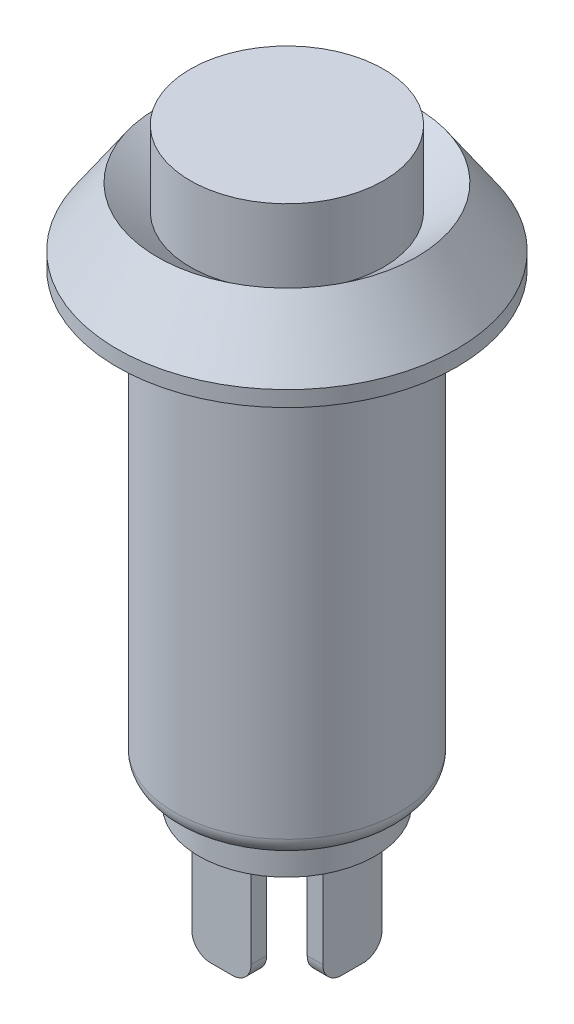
ISO-10303-21;
HEADER;
FILE_DESCRIPTION(('STEP AP214'),'2;1');
FILE_NAME('part.step','',(''),(''),'','','');
FILE_SCHEMA(('AUTOMOTIVE_DESIGN { 1 0 10303 214 1 1 1 1 }'));
ENDSEC;
DATA;
#1=APPLICATION_CONTEXT('core data for automotive mechanical design processes');
#2=APPLICATION_PROTOCOL_DEFINITION('international standard','automotive_design',2000,#1);
#3=PRODUCT_CONTEXT('',#1,'mechanical');
#4=PRODUCT('Part','Part','',(#3));
#5=PRODUCT_RELATED_PRODUCT_CATEGORY('part','',(#4));
#6=PRODUCT_DEFINITION_FORMATION('','',#4);
#7=PRODUCT_DEFINITION_CONTEXT('part definition',#1,'design');
#8=PRODUCT_DEFINITION('design','',#6,#7);
#9=PRODUCT_DEFINITION_SHAPE('','',#8);
#10=(LENGTH_UNIT() NAMED_UNIT(*) SI_UNIT(.MILLI.,.METRE.));
#11=(NAMED_UNIT(*) PLANE_ANGLE_UNIT() SI_UNIT($,.RADIAN.));
#12=(NAMED_UNIT(*) SI_UNIT($,.STERADIAN.) SOLID_ANGLE_UNIT());
#13=UNCERTAINTY_MEASURE_WITH_UNIT(LENGTH_MEASURE(1.E-05),#10,'distance_accuracy_value','');
#14=(GEOMETRIC_REPRESENTATION_CONTEXT(3) GLOBAL_UNCERTAINTY_ASSIGNED_CONTEXT((#13)) GLOBAL_UNIT_ASSIGNED_CONTEXT((#10,
#11,#12)) REPRESENTATION_CONTEXT('',''));
#15=CARTESIAN_POINT('',(0.,0.,0.));
#16=DIRECTION('',(0.,0.,1.));
#17=DIRECTION('',(1.,0.,0.));
#18=AXIS2_PLACEMENT_3D('',#15,#16,#17);
#19=CARTESIAN_POINT('',(0.,-18.9,0.));
#20=DIRECTION('',(0.,-1.,0.));
#21=DIRECTION('',(1.,0.,0.));
#22=AXIS2_PLACEMENT_3D('',#19,#20,#21);
#23=PLANE('',#22);
#24=CARTESIAN_POINT('',(0.,-18.9,0.));
#25=DIRECTION('',(0.,-1.,0.));
#26=DIRECTION('',(1.,0.,0.));
#27=AXIS2_PLACEMENT_3D('',#24,#25,#26);
#28=CIRCLE('',#27,2.825);
#29=CARTESIAN_POINT('',(2.825,-18.9,0.));
#30=VERTEX_POINT('',#29);
#31=EDGE_CURVE('E313',#30,#30,#28,.T.);
#32=ORIENTED_EDGE('',*,*,#31,.T.);
#33=EDGE_LOOP('',(#32));
#34=FACE_BOUND('',#33,.T.);
#35=DIRECTION('',(-1.,0.,0.));
#36=VECTOR('',#35,1.);
#37=CARTESIAN_POINT('',(-0.95,-18.9,2.1));
#38=LINE('',#37,#36);
#39=CARTESIAN_POINT('',(0.95,-18.9,2.1));
#40=VERTEX_POINT('',#39);
#41=CARTESIAN_POINT('',(-0.95,-18.9,2.1));
#42=VERTEX_POINT('',#41);
#43=EDGE_CURVE('E298',#40,#42,#38,.T.);
#44=ORIENTED_EDGE('',*,*,#43,.F.);
#45=DIRECTION('',(0.,0.,1.));
#46=VECTOR('',#45,1.);
#47=CARTESIAN_POINT('',(0.95,-18.9,2.1));
#48=LINE('',#47,#46);
#49=CARTESIAN_POINT('',(0.95,-18.9,1.6));
#50=VERTEX_POINT('',#49);
#51=EDGE_CURVE('E283',#50,#40,#48,.T.);
#52=ORIENTED_EDGE('',*,*,#51,.F.);
#53=DIRECTION('',(1.,0.,0.));
#54=VECTOR('',#53,1.);
#55=CARTESIAN_POINT('',(-0.95,-18.9,1.6));
#56=LINE('',#55,#54);
#57=CARTESIAN_POINT('',(-0.95,-18.9,1.6));
#58=VERTEX_POINT('',#57);
#59=EDGE_CURVE('E292',#58,#50,#56,.T.);
#60=ORIENTED_EDGE('',*,*,#59,.F.);
#61=DIRECTION('',(0.,0.,-1.));
#62=VECTOR('',#61,1.);
#63=CARTESIAN_POINT('',(-0.95,-18.9,2.1));
#64=LINE('',#63,#62);
#65=EDGE_CURVE('E301',#42,#58,#64,.T.);
#66=ORIENTED_EDGE('',*,*,#65,.F.);
#67=EDGE_LOOP('',(#44,#52,#60,#66));
#68=FACE_BOUND('',#67,.T.);
#69=DIRECTION('',(1.,0.,0.));
#70=VECTOR('',#69,1.);
#71=CARTESIAN_POINT('',(2.10000000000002,-18.9,-0.949999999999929));
#72=LINE('',#71,#70);
#73=CARTESIAN_POINT('',(1.60000000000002,-18.9,-0.949999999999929));
#74=VERTEX_POINT('',#73);
#75=CARTESIAN_POINT('',(2.10000000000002,-18.9,-0.949999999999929));
#76=VERTEX_POINT('',#75);
#77=EDGE_CURVE('E277',#74,#76,#72,.T.);
#78=ORIENTED_EDGE('',*,*,#77,.F.);
#79=DIRECTION('',(0.,0.,-1.));
#80=VECTOR('',#79,1.);
#81=CARTESIAN_POINT('',(1.60000000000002,-18.9,0.950000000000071));
#82=LINE('',#81,#80);
#83=CARTESIAN_POINT('',(1.60000000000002,-18.9,0.950000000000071));
#84=VERTEX_POINT('',#83);
#85=EDGE_CURVE('E280',#84,#74,#82,.T.);
#86=ORIENTED_EDGE('',*,*,#85,.F.);
#87=DIRECTION('',(-1.,0.,0.));
#88=VECTOR('',#87,1.);
#89=CARTESIAN_POINT('',(2.10000000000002,-18.9,0.950000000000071));
#90=LINE('',#89,#88);
#91=CARTESIAN_POINT('',(2.10000000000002,-18.9,0.950000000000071));
#92=VERTEX_POINT('',#91);
#93=EDGE_CURVE('E270',#92,#84,#90,.T.);
#94=ORIENTED_EDGE('',*,*,#93,.F.);
#95=DIRECTION('',(0.,0.,1.));
#96=VECTOR('',#95,1.);
#97=CARTESIAN_POINT('',(2.10000000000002,-18.9,0.950000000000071));
#98=LINE('',#97,#96);
#99=EDGE_CURVE('E273',#76,#92,#98,.T.);
#100=ORIENTED_EDGE('',*,*,#99,.F.);
#101=EDGE_LOOP('',(#78,#86,#94,#100));
#102=FACE_BOUND('',#101,.T.);
#103=DIRECTION('',(0.,0.,-1.));
#104=VECTOR('',#103,1.);
#105=CARTESIAN_POINT('',(-0.94999999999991,-18.9,-2.09999999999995));
#106=LINE('',#105,#104);
#107=CARTESIAN_POINT('',(-0.94999999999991,-18.9,-1.59999999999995));
#108=VERTEX_POINT('',#107);
#109=CARTESIAN_POINT('',(-0.94999999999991,-18.9,-2.09999999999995));
#110=VERTEX_POINT('',#109);
#111=EDGE_CURVE('E251',#108,#110,#106,.T.);
#112=ORIENTED_EDGE('',*,*,#111,.F.);
#113=DIRECTION('',(-1.,0.,0.));
#114=VECTOR('',#113,1.);
#115=CARTESIAN_POINT('',(0.95000000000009,-18.9,-1.59999999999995));
#116=LINE('',#115,#114);
#117=CARTESIAN_POINT('',(0.95000000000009,-18.9,-1.59999999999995));
#118=VERTEX_POINT('',#117);
#119=EDGE_CURVE('E254',#118,#108,#116,.T.);
#120=ORIENTED_EDGE('',*,*,#119,.F.);
#121=DIRECTION('',(0.,0.,1.));
#122=VECTOR('',#121,1.);
#123=CARTESIAN_POINT('',(0.95000000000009,-18.9,-2.09999999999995));
#124=LINE('',#123,#122);
#125=CARTESIAN_POINT('',(0.95000000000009,-18.9,-2.09999999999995));
#126=VERTEX_POINT('',#125);
#127=EDGE_CURVE('E244',#126,#118,#124,.T.);
#128=ORIENTED_EDGE('',*,*,#127,.F.);
#129=DIRECTION('',(1.,0.,0.));
#130=VECTOR('',#129,1.);
#131=CARTESIAN_POINT('',(0.95000000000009,-18.9,-2.09999999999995));
#132=LINE('',#131,#130);
#133=EDGE_CURVE('E247',#110,#126,#132,.T.);
#134=ORIENTED_EDGE('',*,*,#133,.F.);
#135=EDGE_LOOP('',(#112,#120,#128,#134));
#136=FACE_BOUND('',#135,.T.);
#137=DIRECTION('',(-1.,0.,0.));
#138=VECTOR('',#137,1.);
#139=CARTESIAN_POINT('',(-2.09999999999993,-18.9,0.949999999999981));
#140=LINE('',#139,#138);
#141=CARTESIAN_POINT('',(-1.59999999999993,-18.9,0.949999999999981));
#142=VERTEX_POINT('',#141);
#143=CARTESIAN_POINT('',(-2.09999999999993,-18.9,0.949999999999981));
#144=VERTEX_POINT('',#143);
#145=EDGE_CURVE('E226',#142,#144,#140,.T.);
#146=ORIENTED_EDGE('',*,*,#145,.F.);
#147=DIRECTION('',(0.,0.,1.));
#148=VECTOR('',#147,1.);
#149=CARTESIAN_POINT('',(-1.59999999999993,-18.9,-0.950000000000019));
#150=LINE('',#149,#148);
#151=CARTESIAN_POINT('',(-1.59999999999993,-18.9,-0.950000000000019));
#152=VERTEX_POINT('',#151);
#153=EDGE_CURVE('E206',#152,#142,#150,.T.);
#154=ORIENTED_EDGE('',*,*,#153,.F.);
#155=DIRECTION('',(1.,0.,0.));
#156=VECTOR('',#155,1.);
#157=CARTESIAN_POINT('',(-2.09999999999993,-18.9,-0.950000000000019));
#158=LINE('',#157,#156);
#159=CARTESIAN_POINT('',(-2.09999999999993,-18.9,-0.950000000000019));
#160=VERTEX_POINT('',#159);
#161=EDGE_CURVE('E216',#160,#152,#158,.T.);
#162=ORIENTED_EDGE('',*,*,#161,.F.);
#163=DIRECTION('',(0.,0.,-1.));
#164=VECTOR('',#163,1.);
#165=CARTESIAN_POINT('',(-2.09999999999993,-18.9,-0.950000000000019));
#166=LINE('',#165,#164);
#167=EDGE_CURVE('E222',#144,#160,#166,.T.);
#168=ORIENTED_EDGE('',*,*,#167,.F.);
#169=EDGE_LOOP('',(#146,#154,#162,#168));
#170=FACE_BOUND('',#169,.T.);
#171=ADVANCED_FACE('F39',(#34,#68,#102,#136,#170),#23,.T.);
#172=CARTESIAN_POINT('',(0.,0.,0.));
#173=DIRECTION('',(0.,1.,0.));
#174=DIRECTION('',(-1.,0.,0.));
#175=AXIS2_PLACEMENT_3D('',#172,#173,#174);
#176=PLANE('',#175);
#177=CARTESIAN_POINT('',(0.,0.,0.));
#178=DIRECTION('',(0.,-1.,0.));
#179=DIRECTION('',(1.,0.,0.));
#180=AXIS2_PLACEMENT_3D('',#177,#178,#179);
#181=CIRCLE('',#180,3.1);
#182=CARTESIAN_POINT('',(3.1,0.,0.));
#183=VERTEX_POINT('',#182);
#184=EDGE_CURVE('E321',#183,#183,#181,.T.);
#185=ORIENTED_EDGE('',*,*,#184,.F.);
#186=EDGE_LOOP('',(#185));
#187=FACE_BOUND('',#186,.T.);
#188=ADVANCED_FACE('F421',(#187),#176,.T.);
#189=CARTESIAN_POINT('',(0.,-17.9,0.));
#190=DIRECTION('',(0.,-1.,0.));
#191=DIRECTION('',(1.,0.,0.));
#192=AXIS2_PLACEMENT_3D('',#189,#190,#191);
#193=CYLINDRICAL_SURFACE('',#192,3.1);
#194=ORIENTED_EDGE('',*,*,#184,.T.);
#195=EDGE_LOOP('',(#194));
#196=FACE_BOUND('',#195,.T.);
#197=CARTESIAN_POINT('',(0.,-2.4,0.));
#198=DIRECTION('',(0.,-1.,0.));
#199=DIRECTION('',(1.,0.,0.));
#200=AXIS2_PLACEMENT_3D('',#197,#198,#199);
#201=CIRCLE('',#200,3.1);
#202=CARTESIAN_POINT('',(3.1,-2.4,0.));
#203=VERTEX_POINT('',#202);
#204=EDGE_CURVE('E333',#203,#203,#201,.T.);
#205=ORIENTED_EDGE('',*,*,#204,.F.);
#206=EDGE_LOOP('',(#205));
#207=FACE_BOUND('',#206,.T.);
#208=ADVANCED_FACE('F427',(#196,#207),#193,.T.);
#209=CARTESIAN_POINT('',(0.,-1.6,0.));
#210=DIRECTION('',(0.,1.,0.));
#211=DIRECTION('',(-1.,0.,0.));
#212=AXIS2_PLACEMENT_3D('',#209,#210,#211);
#213=CONICAL_SURFACE('',#212,4.15,0.919719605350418);
#214=ORIENTED_EDGE('',*,*,#204,.T.);
#215=EDGE_LOOP('',(#214));
#216=FACE_BOUND('',#215,.T.);
#217=CARTESIAN_POINT('',(0.,-1.6,0.));
#218=DIRECTION('',(0.,-1.,0.));
#219=DIRECTION('',(1.,0.,0.));
#220=AXIS2_PLACEMENT_3D('',#217,#218,#219);
#221=CIRCLE('',#220,4.15);
#222=CARTESIAN_POINT('',(4.15,-1.6,0.));
#223=VERTEX_POINT('',#222);
#224=EDGE_CURVE('E330',#223,#223,#221,.T.);
#225=ORIENTED_EDGE('',*,*,#224,.F.);
#226=EDGE_LOOP('',(#225));
#227=FACE_BOUND('',#226,.T.);
#228=ADVANCED_FACE('F456',(#216,#227),#213,.F.);
#229=CARTESIAN_POINT('',(0.,-3.5,0.));
#230=DIRECTION('',(0.,-1.,0.));
#231=DIRECTION('',(1.,0.,0.));
#232=AXIS2_PLACEMENT_3D('',#229,#230,#231);
#233=CONICAL_SURFACE('',#232,5.45,0.600050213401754);
#234=ORIENTED_EDGE('',*,*,#224,.T.);
#235=EDGE_LOOP('',(#234));
#236=FACE_BOUND('',#235,.T.);
#237=CARTESIAN_POINT('',(0.,-3.5,0.));
#238=DIRECTION('',(0.,-1.,0.));
#239=DIRECTION('',(1.,0.,0.));
#240=AXIS2_PLACEMENT_3D('',#237,#238,#239);
#241=CIRCLE('',#240,5.45);
#242=CARTESIAN_POINT('',(5.45,-3.5,0.));
#243=VERTEX_POINT('',#242);
#244=EDGE_CURVE('E327',#243,#243,#241,.T.);
#245=ORIENTED_EDGE('',*,*,#244,.F.);
#246=EDGE_LOOP('',(#245));
#247=FACE_BOUND('',#246,.T.);
#248=ADVANCED_FACE('F452',(#236,#247),#233,.T.);
#249=CARTESIAN_POINT('',(0.,-17.9,0.));
#250=DIRECTION('',(0.,-1.,0.));
#251=DIRECTION('',(1.,0.,0.));
#252=AXIS2_PLACEMENT_3D('',#249,#250,#251);
#253=CYLINDRICAL_SURFACE('',#252,5.45);
#254=ORIENTED_EDGE('',*,*,#244,.T.);
#255=EDGE_LOOP('',(#254));
#256=FACE_BOUND('',#255,.T.);
#257=CARTESIAN_POINT('',(0.,-4.,0.));
#258=DIRECTION('',(0.,-1.,0.));
#259=DIRECTION('',(1.,0.,0.));
#260=AXIS2_PLACEMENT_3D('',#257,#258,#259);
#261=CIRCLE('',#260,5.45);
#262=CARTESIAN_POINT('',(5.45,-4.,0.));
#263=VERTEX_POINT('',#262);
#264=EDGE_CURVE('E324',#263,#263,#261,.T.);
#265=ORIENTED_EDGE('',*,*,#264,.F.);
#266=EDGE_LOOP('',(#265));
#267=FACE_BOUND('',#266,.T.);
#268=ADVANCED_FACE('F448',(#256,#267),#253,.T.);
#269=CARTESIAN_POINT('',(5.45,-4.,0.));
#270=DIRECTION('',(0.,-1.,0.));
#271=DIRECTION('',(1.,0.,0.));
#272=AXIS2_PLACEMENT_3D('',#269,#270,#271);
#273=PLANE('',#272);
#274=ORIENTED_EDGE('',*,*,#264,.T.);
#275=EDGE_LOOP('',(#274));
#276=FACE_BOUND('',#275,.T.);
#277=CARTESIAN_POINT('',(0.,-4.,0.));
#278=DIRECTION('',(0.,-1.,0.));
#279=DIRECTION('',(1.,0.,0.));
#280=AXIS2_PLACEMENT_3D('',#277,#278,#279);
#281=CIRCLE('',#280,3.6);
#282=CARTESIAN_POINT('',(3.6,-4.,0.));
#283=VERTEX_POINT('',#282);
#284=EDGE_CURVE('E316',#283,#283,#281,.T.);
#285=ORIENTED_EDGE('',*,*,#284,.F.);
#286=EDGE_LOOP('',(#285));
#287=FACE_BOUND('',#286,.T.);
#288=ADVANCED_FACE('F444',(#276,#287),#273,.T.);
#289=CARTESIAN_POINT('',(0.,-17.9,0.));
#290=DIRECTION('',(0.,-1.,0.));
#291=DIRECTION('',(1.,0.,0.));
#292=AXIS2_PLACEMENT_3D('',#289,#290,#291);
#293=CYLINDRICAL_SURFACE('',#292,3.6);
#294=CARTESIAN_POINT('',(0.,-17.3,0.));
#295=DIRECTION('',(0.,-1.,0.));
#296=DIRECTION('',(1.,0.,0.));
#297=AXIS2_PLACEMENT_3D('',#294,#295,#296);
#298=CIRCLE('',#297,3.6);
#299=CARTESIAN_POINT('',(3.6,-17.3,0.));
#300=VERTEX_POINT('',#299);
#301=EDGE_CURVE('E11',#300,#300,#298,.F.);
#302=ORIENTED_EDGE('',*,*,#301,.T.);
#303=EDGE_LOOP('',(#302));
#304=FACE_BOUND('',#303,.T.);
#305=ORIENTED_EDGE('',*,*,#284,.T.);
#306=EDGE_LOOP('',(#305));
#307=FACE_BOUND('',#306,.T.);
#308=ADVANCED_FACE('F441',(#304,#307),#293,.T.);
#309=CARTESIAN_POINT('',(3.6,-17.9,0.));
#310=DIRECTION('',(0.,-1.,0.));
#311=DIRECTION('',(1.,0.,0.));
#312=AXIS2_PLACEMENT_3D('',#309,#310,#311);
#313=PLANE('',#312);
#314=CARTESIAN_POINT('',(0.,-17.9,0.));
#315=DIRECTION('',(0.,-1.,0.));
#316=DIRECTION('',(1.,0.,0.));
#317=AXIS2_PLACEMENT_3D('',#314,#315,#316);
#318=CIRCLE('',#317,3.);
#319=CARTESIAN_POINT('',(3.,-17.9,0.));
#320=VERTEX_POINT('',#319);
#321=EDGE_CURVE('E47',#320,#320,#318,.T.);
#322=ORIENTED_EDGE('',*,*,#321,.T.);
#323=EDGE_LOOP('',(#322));
#324=FACE_BOUND('',#323,.T.);
#325=CARTESIAN_POINT('',(0.,-17.9,0.));
#326=DIRECTION('',(0.,-1.,0.));
#327=DIRECTION('',(1.,0.,0.));
#328=AXIS2_PLACEMENT_3D('',#325,#326,#327);
#329=CIRCLE('',#328,2.825);
#330=CARTESIAN_POINT('',(2.825,-17.9,0.));
#331=VERTEX_POINT('',#330);
#332=EDGE_CURVE('E317',#331,#331,#329,.T.);
#333=ORIENTED_EDGE('',*,*,#332,.F.);
#334=EDGE_LOOP('',(#333));
#335=FACE_BOUND('',#334,.T.);
#336=ADVANCED_FACE('F408',(#324,#335),#313,.T.);
#337=CARTESIAN_POINT('',(0.,-18.9,0.));
#338=DIRECTION('',(0.,1.,0.));
#339=DIRECTION('',(-1.,0.,0.));
#340=AXIS2_PLACEMENT_3D('',#337,#338,#339);
#341=CYLINDRICAL_SURFACE('',#340,2.825);
#342=ORIENTED_EDGE('',*,*,#31,.F.);
#343=EDGE_LOOP('',(#342));
#344=FACE_BOUND('',#343,.T.);
#345=ORIENTED_EDGE('',*,*,#332,.T.);
#346=EDGE_LOOP('',(#345));
#347=FACE_BOUND('',#346,.T.);
#348=ADVANCED_FACE('F435',(#344,#347),#341,.T.);
#349=CARTESIAN_POINT('',(0.95,-22.4,2.1));
#350=DIRECTION('',(-1.,0.,0.));
#351=DIRECTION('',(0.,0.,1.));
#352=AXIS2_PLACEMENT_3D('',#349,#350,#351);
#353=PLANE('',#352);
#354=DIRECTION('',(0.,1.,0.));
#355=VECTOR('',#354,1.);
#356=CARTESIAN_POINT('',(0.95,-22.4,2.1));
#357=LINE('',#356,#355);
#358=CARTESIAN_POINT('',(0.95,-21.8,2.1));
#359=VERTEX_POINT('',#358);
#360=EDGE_CURVE('E311',#359,#40,#357,.T.);
#361=ORIENTED_EDGE('',*,*,#360,.F.);
#362=DIRECTION('',(0.,0.,1.));
#363=VECTOR('',#362,1.);
#364=CARTESIAN_POINT('',(0.95,-21.8,1.6));
#365=LINE('',#364,#363);
#366=CARTESIAN_POINT('',(0.95,-21.8,1.6));
#367=VERTEX_POINT('',#366);
#368=EDGE_CURVE('E365',#359,#367,#365,.F.);
#369=ORIENTED_EDGE('',*,*,#368,.T.);
#370=DIRECTION('',(0.,1.,0.));
#371=VECTOR('',#370,1.);
#372=CARTESIAN_POINT('',(0.95,-22.4,1.6));
#373=LINE('',#372,#371);
#374=EDGE_CURVE('E295',#367,#50,#373,.T.);
#375=ORIENTED_EDGE('',*,*,#374,.T.);
#376=ORIENTED_EDGE('',*,*,#51,.T.);
#377=EDGE_LOOP('',(#361,#369,#375,#376));
#378=FACE_BOUND('',#377,.T.);
#379=ADVANCED_FACE('F433',(#378),#353,.F.);
#380=CARTESIAN_POINT('',(-0.95,-22.4,2.1));
#381=DIRECTION('',(0.,0.,-1.));
#382=DIRECTION('',(-1.,0.,0.));
#383=AXIS2_PLACEMENT_3D('',#380,#381,#382);
#384=PLANE('',#383);
#385=DIRECTION('',(-1.,0.,0.));
#386=VECTOR('',#385,1.);
#387=CARTESIAN_POINT('',(-0.95,-22.4,2.1));
#388=LINE('',#387,#386);
#389=CARTESIAN_POINT('',(0.349999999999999,-22.4,2.1));
#390=VERTEX_POINT('',#389);
#391=CARTESIAN_POINT('',(-0.350000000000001,-22.4,2.1));
#392=VERTEX_POINT('',#391);
#393=EDGE_CURVE('E288',#390,#392,#388,.T.);
#394=ORIENTED_EDGE('',*,*,#393,.F.);
#395=CARTESIAN_POINT('',(0.35,-21.8,2.1));
#396=DIRECTION('',(0.,0.,-1.));
#397=DIRECTION('',(-1.,0.,0.));
#398=AXIS2_PLACEMENT_3D('',#395,#396,#397);
#399=CIRCLE('',#398,0.6);
#400=EDGE_CURVE('E363',#390,#359,#399,.F.);
#401=ORIENTED_EDGE('',*,*,#400,.T.);
#402=ORIENTED_EDGE('',*,*,#360,.T.);
#403=ORIENTED_EDGE('',*,*,#43,.T.);
#404=DIRECTION('',(0.,1.,0.));
#405=VECTOR('',#404,1.);
#406=CARTESIAN_POINT('',(-0.95,-22.4,2.1));
#407=LINE('',#406,#405);
#408=CARTESIAN_POINT('',(-0.95,-21.8,2.1));
#409=VERTEX_POINT('',#408);
#410=EDGE_CURVE('E309',#409,#42,#407,.T.);
#411=ORIENTED_EDGE('',*,*,#410,.F.);
#412=CARTESIAN_POINT('',(-0.35,-21.8,2.1));
#413=DIRECTION('',(0.,0.,-1.));
#414=DIRECTION('',(-1.,0.,0.));
#415=AXIS2_PLACEMENT_3D('',#412,#413,#414);
#416=CIRCLE('',#415,0.6);
#417=EDGE_CURVE('E361',#409,#392,#416,.F.);
#418=ORIENTED_EDGE('',*,*,#417,.T.);
#419=EDGE_LOOP('',(#394,#401,#402,#403,#411,#418));
#420=FACE_BOUND('',#419,.T.);
#421=ADVANCED_FACE('F553',(#420),#384,.F.);
#422=CARTESIAN_POINT('',(-0.95,-22.4,2.1));
#423=DIRECTION('',(1.,0.,0.));
#424=DIRECTION('',(0.,0.,-1.));
#425=AXIS2_PLACEMENT_3D('',#422,#423,#424);
#426=PLANE('',#425);
#427=DIRECTION('',(0.,1.,0.));
#428=VECTOR('',#427,1.);
#429=CARTESIAN_POINT('',(-0.95,-22.4,1.6));
#430=LINE('',#429,#428);
#431=CARTESIAN_POINT('',(-0.95,-21.8,1.6));
#432=VERTEX_POINT('',#431);
#433=EDGE_CURVE('E307',#432,#58,#430,.T.);
#434=ORIENTED_EDGE('',*,*,#433,.F.);
#435=DIRECTION('',(0.,0.,-1.));
#436=VECTOR('',#435,1.);
#437=CARTESIAN_POINT('',(-0.95,-21.8,2.1));
#438=LINE('',#437,#436);
#439=EDGE_CURVE('E371',#432,#409,#438,.F.);
#440=ORIENTED_EDGE('',*,*,#439,.T.);
#441=ORIENTED_EDGE('',*,*,#410,.T.);
#442=ORIENTED_EDGE('',*,*,#65,.T.);
#443=EDGE_LOOP('',(#434,#440,#441,#442));
#444=FACE_BOUND('',#443,.T.);
#445=ADVANCED_FACE('F550',(#444),#426,.F.);
#446=CARTESIAN_POINT('',(-0.95,-22.4,1.6));
#447=DIRECTION('',(0.,0.,1.));
#448=DIRECTION('',(1.,0.,0.));
#449=AXIS2_PLACEMENT_3D('',#446,#447,#448);
#450=PLANE('',#449);
#451=ORIENTED_EDGE('',*,*,#374,.F.);
#452=CARTESIAN_POINT('',(0.35,-21.8,1.6));
#453=DIRECTION('',(0.,0.,1.));
#454=DIRECTION('',(1.,0.,0.));
#455=AXIS2_PLACEMENT_3D('',#452,#453,#454);
#456=CIRCLE('',#455,0.6);
#457=CARTESIAN_POINT('',(0.349999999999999,-22.4,1.6));
#458=VERTEX_POINT('',#457);
#459=EDGE_CURVE('E369',#367,#458,#456,.F.);
#460=ORIENTED_EDGE('',*,*,#459,.T.);
#461=DIRECTION('',(1.,0.,0.));
#462=VECTOR('',#461,1.);
#463=CARTESIAN_POINT('',(-0.95,-22.4,1.6));
#464=LINE('',#463,#462);
#465=CARTESIAN_POINT('',(-0.350000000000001,-22.4,1.6));
#466=VERTEX_POINT('',#465);
#467=EDGE_CURVE('E291',#466,#458,#464,.T.);
#468=ORIENTED_EDGE('',*,*,#467,.F.);
#469=CARTESIAN_POINT('',(-0.35,-21.8,1.6));
#470=DIRECTION('',(0.,0.,1.));
#471=DIRECTION('',(1.,0.,0.));
#472=AXIS2_PLACEMENT_3D('',#469,#470,#471);
#473=CIRCLE('',#472,0.6);
#474=EDGE_CURVE('E367',#466,#432,#473,.F.);
#475=ORIENTED_EDGE('',*,*,#474,.T.);
#476=ORIENTED_EDGE('',*,*,#433,.T.);
#477=ORIENTED_EDGE('',*,*,#59,.T.);
#478=EDGE_LOOP('',(#451,#460,#468,#475,#476,#477));
#479=FACE_BOUND('',#478,.T.);
#480=ADVANCED_FACE('F546',(#479),#450,.F.);
#481=CARTESIAN_POINT('',(0.,-22.4,0.));
#482=DIRECTION('',(0.,-1.,0.));
#483=DIRECTION('',(0.,0.,-1.));
#484=AXIS2_PLACEMENT_3D('',#481,#482,#483);
#485=PLANE('',#484);
#486=ORIENTED_EDGE('',*,*,#467,.T.);
#487=DIRECTION('',(0.,0.,1.));
#488=VECTOR('',#487,1.);
#489=CARTESIAN_POINT('',(0.35,-22.4,2.1));
#490=LINE('',#489,#488);
#491=EDGE_CURVE('E358',#458,#390,#490,.T.);
#492=ORIENTED_EDGE('',*,*,#491,.T.);
#493=ORIENTED_EDGE('',*,*,#393,.T.);
#494=DIRECTION('',(0.,0.,-1.));
#495=VECTOR('',#494,1.);
#496=CARTESIAN_POINT('',(-0.35,-22.4,1.6));
#497=LINE('',#496,#495);
#498=EDGE_CURVE('E355',#392,#466,#497,.T.);
#499=ORIENTED_EDGE('',*,*,#498,.T.);
#500=EDGE_LOOP('',(#486,#492,#493,#499));
#501=FACE_BOUND('',#500,.T.);
#502=ADVANCED_FACE('F527',(#501),#485,.T.);
#503=CARTESIAN_POINT('',(1.60000000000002,-22.4,0.950000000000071));
#504=DIRECTION('',(1.,0.,0.));
#505=DIRECTION('',(0.,1.,0.));
#506=AXIS2_PLACEMENT_3D('',#503,#504,#505);
#507=PLANE('',#506);
#508=DIRECTION('',(0.,1.,0.));
#509=VECTOR('',#508,1.);
#510=CARTESIAN_POINT('',(1.60000000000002,-22.4,-0.949999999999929));
#511=LINE('',#510,#509);
#512=CARTESIAN_POINT('',(1.60000000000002,-21.8,-0.949999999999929));
#513=VERTEX_POINT('',#512);
#514=EDGE_CURVE('E257',#513,#74,#511,.T.);
#515=ORIENTED_EDGE('',*,*,#514,.F.);
#516=CARTESIAN_POINT('',(1.60000000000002,-21.8,-0.349999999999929));
#517=DIRECTION('',(1.,0.,0.));
#518=DIRECTION('',(0.,1.,0.));
#519=AXIS2_PLACEMENT_3D('',#516,#517,#518);
#520=CIRCLE('',#519,0.6);
#521=CARTESIAN_POINT('',(1.60000000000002,-22.4,-0.349999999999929));
#522=VERTEX_POINT('',#521);
#523=EDGE_CURVE('E351',#513,#522,#520,.F.);
#524=ORIENTED_EDGE('',*,*,#523,.T.);
#525=DIRECTION('',(0.,0.,-1.));
#526=VECTOR('',#525,1.);
#527=CARTESIAN_POINT('',(1.60000000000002,-22.4,0.950000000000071));
#528=LINE('',#527,#526);
#529=CARTESIAN_POINT('',(1.60000000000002,-22.4,0.350000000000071));
#530=VERTEX_POINT('',#529);
#531=EDGE_CURVE('E274',#530,#522,#528,.T.);
#532=ORIENTED_EDGE('',*,*,#531,.F.);
#533=CARTESIAN_POINT('',(1.60000000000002,-21.8,0.350000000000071));
#534=DIRECTION('',(1.,0.,0.));
#535=DIRECTION('',(0.,1.,0.));
#536=AXIS2_PLACEMENT_3D('',#533,#534,#535);
#537=CIRCLE('',#536,0.6);
#538=CARTESIAN_POINT('',(1.60000000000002,-21.8,0.950000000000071));
#539=VERTEX_POINT('',#538);
#540=EDGE_CURVE('E349',#530,#539,#537,.F.);
#541=ORIENTED_EDGE('',*,*,#540,.T.);
#542=DIRECTION('',(0.,1.,0.));
#543=VECTOR('',#542,1.);
#544=CARTESIAN_POINT('',(1.60000000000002,-22.4,0.950000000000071));
#545=LINE('',#544,#543);
#546=EDGE_CURVE('E267',#539,#84,#545,.T.);
#547=ORIENTED_EDGE('',*,*,#546,.T.);
#548=ORIENTED_EDGE('',*,*,#85,.T.);
#549=EDGE_LOOP('',(#515,#524,#532,#541,#547,#548));
#550=FACE_BOUND('',#549,.T.);
#551=ADVANCED_FACE('F523',(#550),#507,.F.);
#552=CARTESIAN_POINT('',(2.10000000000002,-22.4,-0.949999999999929));
#553=DIRECTION('',(0.,0.,1.));
#554=DIRECTION('',(1.,0.,0.));
#555=AXIS2_PLACEMENT_3D('',#552,#553,#554);
#556=PLANE('',#555);
#557=DIRECTION('',(0.,1.,0.));
#558=VECTOR('',#557,1.);
#559=CARTESIAN_POINT('',(2.10000000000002,-22.4,-0.949999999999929));
#560=LINE('',#559,#558);
#561=CARTESIAN_POINT('',(2.10000000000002,-21.8,-0.949999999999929));
#562=VERTEX_POINT('',#561);
#563=EDGE_CURVE('E263',#562,#76,#560,.T.);
#564=ORIENTED_EDGE('',*,*,#563,.F.);
#565=DIRECTION('',(1.,0.,0.));
#566=VECTOR('',#565,1.);
#567=CARTESIAN_POINT('',(2.10000000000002,-21.8,-0.949999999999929));
#568=LINE('',#567,#566);
#569=EDGE_CURVE('E347',#562,#513,#568,.F.);
#570=ORIENTED_EDGE('',*,*,#569,.T.);
#571=ORIENTED_EDGE('',*,*,#514,.T.);
#572=ORIENTED_EDGE('',*,*,#77,.T.);
#573=EDGE_LOOP('',(#564,#570,#571,#572));
#574=FACE_BOUND('',#573,.T.);
#575=ADVANCED_FACE('F526',(#574),#556,.F.);
#576=CARTESIAN_POINT('',(2.10000000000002,-22.4,0.950000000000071));
#577=DIRECTION('',(-1.,0.,0.));
#578=DIRECTION('',(0.,-1.,0.));
#579=AXIS2_PLACEMENT_3D('',#576,#577,#578);
#580=PLANE('',#579);
#581=DIRECTION('',(0.,0.,1.));
#582=VECTOR('',#581,1.);
#583=CARTESIAN_POINT('',(2.10000000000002,-22.4,0.950000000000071));
#584=LINE('',#583,#582);
#585=CARTESIAN_POINT('',(2.10000000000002,-22.4,-0.349999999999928));
#586=VERTEX_POINT('',#585);
#587=CARTESIAN_POINT('',(2.10000000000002,-22.4,0.350000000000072));
#588=VERTEX_POINT('',#587);
#589=EDGE_CURVE('E269',#586,#588,#584,.T.);
#590=ORIENTED_EDGE('',*,*,#589,.F.);
#591=CARTESIAN_POINT('',(2.10000000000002,-21.8,-0.349999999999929));
#592=DIRECTION('',(-1.,0.,0.));
#593=DIRECTION('',(0.,-1.,0.));
#594=AXIS2_PLACEMENT_3D('',#591,#592,#593);
#595=CIRCLE('',#594,0.6);
#596=EDGE_CURVE('E345',#586,#562,#595,.F.);
#597=ORIENTED_EDGE('',*,*,#596,.T.);
#598=ORIENTED_EDGE('',*,*,#563,.T.);
#599=ORIENTED_EDGE('',*,*,#99,.T.);
#600=DIRECTION('',(0.,1.,0.));
#601=VECTOR('',#600,1.);
#602=CARTESIAN_POINT('',(2.10000000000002,-22.4,0.950000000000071));
#603=LINE('',#602,#601);
#604=CARTESIAN_POINT('',(2.10000000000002,-21.8,0.950000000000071));
#605=VERTEX_POINT('',#604);
#606=EDGE_CURVE('E265',#605,#92,#603,.T.);
#607=ORIENTED_EDGE('',*,*,#606,.F.);
#608=CARTESIAN_POINT('',(2.10000000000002,-21.8,0.350000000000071));
#609=DIRECTION('',(-1.,0.,0.));
#610=DIRECTION('',(0.,-1.,0.));
#611=AXIS2_PLACEMENT_3D('',#608,#609,#610);
#612=CIRCLE('',#611,0.6);
#613=EDGE_CURVE('E343',#605,#588,#612,.F.);
#614=ORIENTED_EDGE('',*,*,#613,.T.);
#615=EDGE_LOOP('',(#590,#597,#598,#599,#607,#614));
#616=FACE_BOUND('',#615,.T.);
#617=ADVANCED_FACE('F531',(#616),#580,.F.);
#618=CARTESIAN_POINT('',(2.10000000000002,-22.4,0.950000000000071));
#619=DIRECTION('',(0.,0.,-1.));
#620=DIRECTION('',(-1.,0.,0.));
#621=AXIS2_PLACEMENT_3D('',#618,#619,#620);
#622=PLANE('',#621);
#623=ORIENTED_EDGE('',*,*,#546,.F.);
#624=DIRECTION('',(-1.,0.,0.));
#625=VECTOR('',#624,1.);
#626=CARTESIAN_POINT('',(2.10000000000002,-21.8,0.950000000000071));
#627=LINE('',#626,#625);
#628=EDGE_CURVE('E353',#539,#605,#627,.F.);
#629=ORIENTED_EDGE('',*,*,#628,.T.);
#630=ORIENTED_EDGE('',*,*,#606,.T.);
#631=ORIENTED_EDGE('',*,*,#93,.T.);
#632=EDGE_LOOP('',(#623,#629,#630,#631));
#633=FACE_BOUND('',#632,.T.);
#634=ADVANCED_FACE('F535',(#633),#622,.F.);
#635=CARTESIAN_POINT('',(0.,-22.4,0.));
#636=DIRECTION('',(0.,1.,0.));
#637=DIRECTION('',(0.,0.,1.));
#638=AXIS2_PLACEMENT_3D('',#635,#636,#637);
#639=PLANE('',#638);
#640=ORIENTED_EDGE('',*,*,#531,.T.);
#641=DIRECTION('',(1.,0.,0.));
#642=VECTOR('',#641,1.);
#643=CARTESIAN_POINT('',(0.,-22.4,-0.34999999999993));
#644=LINE('',#643,#642);
#645=EDGE_CURVE('E340',#522,#586,#644,.T.);
#646=ORIENTED_EDGE('',*,*,#645,.T.);
#647=ORIENTED_EDGE('',*,*,#589,.T.);
#648=DIRECTION('',(-1.,0.,0.));
#649=VECTOR('',#648,1.);
#650=CARTESIAN_POINT('',(0.,-22.4,0.350000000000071));
#651=LINE('',#650,#649);
#652=EDGE_CURVE('E320',#588,#530,#651,.T.);
#653=ORIENTED_EDGE('',*,*,#652,.T.);
#654=EDGE_LOOP('',(#640,#646,#647,#653));
#655=FACE_BOUND('',#654,.T.);
#656=ADVANCED_FACE('F539',(#655),#639,.F.);
#657=CARTESIAN_POINT('',(0.95000000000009,-22.4,-1.59999999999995));
#658=DIRECTION('',(0.,0.,-1.));
#659=DIRECTION('',(-1.,0.,0.));
#660=AXIS2_PLACEMENT_3D('',#657,#658,#659);
#661=PLANE('',#660);
#662=DIRECTION('',(-1.,0.,0.));
#663=VECTOR('',#662,1.);
#664=CARTESIAN_POINT('',(0.95000000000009,-22.4,-1.59999999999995));
#665=LINE('',#664,#663);
#666=CARTESIAN_POINT('',(0.35000000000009,-22.4,-1.59999999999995));
#667=VERTEX_POINT('',#666);
#668=CARTESIAN_POINT('',(-0.34999999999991,-22.4,-1.59999999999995));
#669=VERTEX_POINT('',#668);
#670=EDGE_CURVE('E248',#667,#669,#665,.T.);
#671=ORIENTED_EDGE('',*,*,#670,.F.);
#672=CARTESIAN_POINT('',(0.35000000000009,-21.8,-1.59999999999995));
#673=DIRECTION('',(0.,0.,-1.));
#674=DIRECTION('',(-1.,0.,0.));
#675=AXIS2_PLACEMENT_3D('',#672,#673,#674);
#676=CIRCLE('',#675,0.6);
#677=CARTESIAN_POINT('',(0.95000000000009,-21.8,-1.59999999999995));
#678=VERTEX_POINT('',#677);
#679=EDGE_CURVE('E398',#667,#678,#676,.F.);
#680=ORIENTED_EDGE('',*,*,#679,.T.);
#681=DIRECTION('',(0.,1.,0.));
#682=VECTOR('',#681,1.);
#683=CARTESIAN_POINT('',(0.95000000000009,-22.4,-1.59999999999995));
#684=LINE('',#683,#682);
#685=EDGE_CURVE('E241',#678,#118,#684,.T.);
#686=ORIENTED_EDGE('',*,*,#685,.T.);
#687=ORIENTED_EDGE('',*,*,#119,.T.);
#688=DIRECTION('',(0.,1.,0.));
#689=VECTOR('',#688,1.);
#690=CARTESIAN_POINT('',(-0.94999999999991,-22.4,-1.59999999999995));
#691=LINE('',#690,#689);
#692=CARTESIAN_POINT('',(-0.94999999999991,-21.8,-1.59999999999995));
#693=VERTEX_POINT('',#692);
#694=EDGE_CURVE('E227',#693,#108,#691,.T.);
#695=ORIENTED_EDGE('',*,*,#694,.F.);
#696=CARTESIAN_POINT('',(-0.34999999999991,-21.8,-1.59999999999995));
#697=DIRECTION('',(0.,0.,-1.));
#698=DIRECTION('',(-1.,0.,0.));
#699=AXIS2_PLACEMENT_3D('',#696,#697,#698);
#700=CIRCLE('',#699,0.6);
#701=EDGE_CURVE('E396',#693,#669,#700,.F.);
#702=ORIENTED_EDGE('',*,*,#701,.T.);
#703=EDGE_LOOP('',(#671,#680,#686,#687,#695,#702));
#704=FACE_BOUND('',#703,.T.);
#705=ADVANCED_FACE('F506',(#704),#661,.F.);
#706=CARTESIAN_POINT('',(-0.94999999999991,-22.4,-2.09999999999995));
#707=DIRECTION('',(1.,0.,0.));
#708=DIRECTION('',(0.,0.,-1.));
#709=AXIS2_PLACEMENT_3D('',#706,#707,#708);
#710=PLANE('',#709);
#711=DIRECTION('',(0.,1.,0.));
#712=VECTOR('',#711,1.);
#713=CARTESIAN_POINT('',(-0.94999999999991,-22.4,-2.09999999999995));
#714=LINE('',#713,#712);
#715=CARTESIAN_POINT('',(-0.94999999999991,-21.8,-2.09999999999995));
#716=VERTEX_POINT('',#715);
#717=EDGE_CURVE('E229',#716,#110,#714,.T.);
#718=ORIENTED_EDGE('',*,*,#717,.F.);
#719=DIRECTION('',(0.,0.,-1.));
#720=VECTOR('',#719,1.);
#721=CARTESIAN_POINT('',(-0.94999999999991,-21.8,-2.09999999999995));
#722=LINE('',#721,#720);
#723=EDGE_CURVE('E404',#716,#693,#722,.F.);
#724=ORIENTED_EDGE('',*,*,#723,.T.);
#725=ORIENTED_EDGE('',*,*,#694,.T.);
#726=ORIENTED_EDGE('',*,*,#111,.T.);
#727=EDGE_LOOP('',(#718,#724,#725,#726));
#728=FACE_BOUND('',#727,.T.);
#729=ADVANCED_FACE('F504',(#728),#710,.F.);
#730=CARTESIAN_POINT('',(0.95000000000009,-22.4,-2.09999999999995));
#731=DIRECTION('',(0.,0.,1.));
#732=DIRECTION('',(1.,0.,0.));
#733=AXIS2_PLACEMENT_3D('',#730,#731,#732);
#734=PLANE('',#733);
#735=DIRECTION('',(0.,1.,0.));
#736=VECTOR('',#735,1.);
#737=CARTESIAN_POINT('',(0.95000000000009,-22.4,-2.09999999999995));
#738=LINE('',#737,#736);
#739=CARTESIAN_POINT('',(0.95000000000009,-21.8,-2.09999999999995));
#740=VERTEX_POINT('',#739);
#741=EDGE_CURVE('E239',#740,#126,#738,.T.);
#742=ORIENTED_EDGE('',*,*,#741,.F.);
#743=CARTESIAN_POINT('',(0.35000000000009,-21.8,-2.09999999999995));
#744=DIRECTION('',(0.,0.,1.));
#745=DIRECTION('',(1.,0.,0.));
#746=AXIS2_PLACEMENT_3D('',#743,#744,#745);
#747=CIRCLE('',#746,0.6);
#748=CARTESIAN_POINT('',(0.35000000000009,-22.4,-2.09999999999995));
#749=VERTEX_POINT('',#748);
#750=EDGE_CURVE('E402',#740,#749,#747,.F.);
#751=ORIENTED_EDGE('',*,*,#750,.T.);
#752=DIRECTION('',(1.,0.,0.));
#753=VECTOR('',#752,1.);
#754=CARTESIAN_POINT('',(0.95000000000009,-22.4,-2.09999999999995));
#755=LINE('',#754,#753);
#756=CARTESIAN_POINT('',(-0.34999999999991,-22.4,-2.09999999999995));
#757=VERTEX_POINT('',#756);
#758=EDGE_CURVE('E243',#757,#749,#755,.T.);
#759=ORIENTED_EDGE('',*,*,#758,.F.);
#760=CARTESIAN_POINT('',(-0.34999999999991,-21.8,-2.09999999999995));
#761=DIRECTION('',(0.,0.,1.));
#762=DIRECTION('',(1.,0.,0.));
#763=AXIS2_PLACEMENT_3D('',#760,#761,#762);
#764=CIRCLE('',#763,0.6);
#765=EDGE_CURVE('E54',#757,#716,#764,.F.);
#766=ORIENTED_EDGE('',*,*,#765,.T.);
#767=ORIENTED_EDGE('',*,*,#717,.T.);
#768=ORIENTED_EDGE('',*,*,#133,.T.);
#769=EDGE_LOOP('',(#742,#751,#759,#766,#767,#768));
#770=FACE_BOUND('',#769,.T.);
#771=ADVANCED_FACE('F495',(#770),#734,.F.);
#772=CARTESIAN_POINT('',(0.95000000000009,-22.4,-2.09999999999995));
#773=DIRECTION('',(-1.,0.,0.));
#774=DIRECTION('',(0.,0.,1.));
#775=AXIS2_PLACEMENT_3D('',#772,#773,#774);
#776=PLANE('',#775);
#777=ORIENTED_EDGE('',*,*,#685,.F.);
#778=DIRECTION('',(0.,0.,1.));
#779=VECTOR('',#778,1.);
#780=CARTESIAN_POINT('',(0.95000000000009,-21.8,-2.09999999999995));
#781=LINE('',#780,#779);
#782=EDGE_CURVE('E62',#678,#740,#781,.F.);
#783=ORIENTED_EDGE('',*,*,#782,.T.);
#784=ORIENTED_EDGE('',*,*,#741,.T.);
#785=ORIENTED_EDGE('',*,*,#127,.T.);
#786=EDGE_LOOP('',(#777,#783,#784,#785));
#787=FACE_BOUND('',#786,.T.);
#788=ADVANCED_FACE('F512',(#787),#776,.F.);
#789=CARTESIAN_POINT('',(0.,-22.4,0.));
#790=DIRECTION('',(0.,1.,0.));
#791=DIRECTION('',(0.,0.,1.));
#792=AXIS2_PLACEMENT_3D('',#789,#790,#791);
#793=PLANE('',#792);
#794=ORIENTED_EDGE('',*,*,#758,.T.);
#795=DIRECTION('',(0.,0.,1.));
#796=VECTOR('',#795,1.);
#797=CARTESIAN_POINT('',(0.35000000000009,-22.4,0.));
#798=LINE('',#797,#796);
#799=EDGE_CURVE('E393',#749,#667,#798,.T.);
#800=ORIENTED_EDGE('',*,*,#799,.T.);
#801=ORIENTED_EDGE('',*,*,#670,.T.);
#802=DIRECTION('',(0.,0.,-1.));
#803=VECTOR('',#802,1.);
#804=CARTESIAN_POINT('',(-0.349999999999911,-22.4,0.));
#805=LINE('',#804,#803);
#806=EDGE_CURVE('E390',#669,#757,#805,.T.);
#807=ORIENTED_EDGE('',*,*,#806,.T.);
#808=EDGE_LOOP('',(#794,#800,#801,#807));
#809=FACE_BOUND('',#808,.T.);
#810=ADVANCED_FACE('F497',(#809),#793,.F.);
#811=CARTESIAN_POINT('',(-1.59999999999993,-22.4,-0.950000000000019));
#812=DIRECTION('',(-1.,0.,0.));
#813=DIRECTION('',(0.,0.,1.));
#814=AXIS2_PLACEMENT_3D('',#811,#812,#813);
#815=PLANE('',#814);
#816=DIRECTION('',(0.,1.,0.));
#817=VECTOR('',#816,1.);
#818=CARTESIAN_POINT('',(-1.59999999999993,-22.4,0.949999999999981));
#819=LINE('',#818,#817);
#820=CARTESIAN_POINT('',(-1.59999999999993,-21.8,0.949999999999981));
#821=VERTEX_POINT('',#820);
#822=EDGE_CURVE('E910',#821,#142,#819,.T.);
#823=ORIENTED_EDGE('',*,*,#822,.F.);
#824=CARTESIAN_POINT('',(-1.59999999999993,-21.8,0.349999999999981));
#825=DIRECTION('',(-1.,0.,0.));
#826=DIRECTION('',(0.,0.,1.));
#827=AXIS2_PLACEMENT_3D('',#824,#825,#826);
#828=CIRCLE('',#827,0.6);
#829=CARTESIAN_POINT('',(-1.59999999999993,-22.4,0.349999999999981));
#830=VERTEX_POINT('',#829);
#831=EDGE_CURVE('E386',#821,#830,#828,.F.);
#832=ORIENTED_EDGE('',*,*,#831,.T.);
#833=DIRECTION('',(0.,0.,1.));
#834=VECTOR('',#833,1.);
#835=CARTESIAN_POINT('',(-1.59999999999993,-22.4,-0.950000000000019));
#836=LINE('',#835,#834);
#837=CARTESIAN_POINT('',(-1.59999999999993,-22.4,-0.350000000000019));
#838=VERTEX_POINT('',#837);
#839=EDGE_CURVE('E223',#838,#830,#836,.T.);
#840=ORIENTED_EDGE('',*,*,#839,.F.);
#841=CARTESIAN_POINT('',(-1.59999999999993,-21.8,-0.350000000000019));
#842=DIRECTION('',(-1.,0.,0.));
#843=DIRECTION('',(0.,0.,1.));
#844=AXIS2_PLACEMENT_3D('',#841,#842,#843);
#845=CIRCLE('',#844,0.6);
#846=CARTESIAN_POINT('',(-1.59999999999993,-21.8,-0.950000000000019));
#847=VERTEX_POINT('',#846);
#848=EDGE_CURVE('E209',#838,#847,#845,.F.);
#849=ORIENTED_EDGE('',*,*,#848,.T.);
#850=DIRECTION('',(0.,1.,0.));
#851=VECTOR('',#850,1.);
#852=CARTESIAN_POINT('',(-1.59999999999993,-22.4,-0.950000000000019));
#853=LINE('',#852,#851);
#854=EDGE_CURVE('E201',#847,#152,#853,.T.);
#855=ORIENTED_EDGE('',*,*,#854,.T.);
#856=ORIENTED_EDGE('',*,*,#153,.T.);
#857=EDGE_LOOP('',(#823,#832,#840,#849,#855,#856));
#858=FACE_BOUND('',#857,.T.);
#859=ADVANCED_FACE('F204',(#858),#815,.F.);
#860=CARTESIAN_POINT('',(-2.09999999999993,-22.4,0.949999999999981));
#861=DIRECTION('',(0.,0.,-1.));
#862=DIRECTION('',(-1.,0.,0.));
#863=AXIS2_PLACEMENT_3D('',#860,#861,#862);
#864=PLANE('',#863);
#865=DIRECTION('',(0.,1.,0.));
#866=VECTOR('',#865,1.);
#867=CARTESIAN_POINT('',(-2.09999999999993,-22.4,0.949999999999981));
#868=LINE('',#867,#866);
#869=CARTESIAN_POINT('',(-2.09999999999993,-21.8,0.949999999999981));
#870=VERTEX_POINT('',#869);
#871=EDGE_CURVE('E909',#870,#144,#868,.T.);
#872=ORIENTED_EDGE('',*,*,#871,.F.);
#873=DIRECTION('',(-1.,0.,0.));
#874=VECTOR('',#873,1.);
#875=CARTESIAN_POINT('',(-2.09999999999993,-21.8,0.949999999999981));
#876=LINE('',#875,#874);
#877=EDGE_CURVE('E383',#870,#821,#876,.F.);
#878=ORIENTED_EDGE('',*,*,#877,.T.);
#879=ORIENTED_EDGE('',*,*,#822,.T.);
#880=ORIENTED_EDGE('',*,*,#145,.T.);
#881=EDGE_LOOP('',(#872,#878,#879,#880));
#882=FACE_BOUND('',#881,.T.);
#883=ADVANCED_FACE('F787',(#882),#864,.F.);
#884=CARTESIAN_POINT('',(-2.09999999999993,-22.4,-0.950000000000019));
#885=DIRECTION('',(1.,0.,0.));
#886=DIRECTION('',(0.,1.,0.));
#887=AXIS2_PLACEMENT_3D('',#884,#885,#886);
#888=PLANE('',#887);
#889=DIRECTION('',(0.,0.,-1.));
#890=VECTOR('',#889,1.);
#891=CARTESIAN_POINT('',(-2.09999999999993,-22.4,-0.950000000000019));
#892=LINE('',#891,#890);
#893=CARTESIAN_POINT('',(-2.09999999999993,-22.4,0.349999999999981));
#894=VERTEX_POINT('',#893);
#895=CARTESIAN_POINT('',(-2.09999999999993,-22.4,-0.350000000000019));
#896=VERTEX_POINT('',#895);
#897=EDGE_CURVE('E212',#894,#896,#892,.T.);
#898=ORIENTED_EDGE('',*,*,#897,.F.);
#899=CARTESIAN_POINT('',(-2.09999999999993,-21.8,0.349999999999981));
#900=DIRECTION('',(1.,0.,0.));
#901=DIRECTION('',(0.,1.,0.));
#902=AXIS2_PLACEMENT_3D('',#899,#900,#901);
#903=CIRCLE('',#902,0.6);
#904=EDGE_CURVE('E381',#894,#870,#903,.F.);
#905=ORIENTED_EDGE('',*,*,#904,.T.);
#906=ORIENTED_EDGE('',*,*,#871,.T.);
#907=ORIENTED_EDGE('',*,*,#167,.T.);
#908=DIRECTION('',(0.,1.,0.));
#909=VECTOR('',#908,1.);
#910=CARTESIAN_POINT('',(-2.09999999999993,-22.4,-0.950000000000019));
#911=LINE('',#910,#909);
#912=CARTESIAN_POINT('',(-2.09999999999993,-21.8,-0.950000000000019));
#913=VERTEX_POINT('',#912);
#914=EDGE_CURVE('E213',#913,#160,#911,.T.);
#915=ORIENTED_EDGE('',*,*,#914,.F.);
#916=CARTESIAN_POINT('',(-2.09999999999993,-21.8,-0.350000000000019));
#917=DIRECTION('',(1.,0.,0.));
#918=DIRECTION('',(0.,1.,0.));
#919=AXIS2_PLACEMENT_3D('',#916,#917,#918);
#920=CIRCLE('',#919,0.6);
#921=EDGE_CURVE('E379',#913,#896,#920,.F.);
#922=ORIENTED_EDGE('',*,*,#921,.T.);
#923=EDGE_LOOP('',(#898,#905,#906,#907,#915,#922));
#924=FACE_BOUND('',#923,.T.);
#925=ADVANCED_FACE('F797',(#924),#888,.F.);
#926=CARTESIAN_POINT('',(-2.09999999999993,-22.4,-0.950000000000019));
#927=DIRECTION('',(0.,0.,1.));
#928=DIRECTION('',(1.,0.,0.));
#929=AXIS2_PLACEMENT_3D('',#926,#927,#928);
#930=PLANE('',#929);
#931=ORIENTED_EDGE('',*,*,#854,.F.);
#932=DIRECTION('',(1.,0.,0.));
#933=VECTOR('',#932,1.);
#934=CARTESIAN_POINT('',(-2.09999999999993,-21.8,-0.950000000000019));
#935=LINE('',#934,#933);
#936=EDGE_CURVE('E388',#847,#913,#935,.F.);
#937=ORIENTED_EDGE('',*,*,#936,.T.);
#938=ORIENTED_EDGE('',*,*,#914,.T.);
#939=ORIENTED_EDGE('',*,*,#161,.T.);
#940=EDGE_LOOP('',(#931,#937,#938,#939));
#941=FACE_BOUND('',#940,.T.);
#942=ADVANCED_FACE('F217',(#941),#930,.F.);
#943=CARTESIAN_POINT('',(0.,-22.4,0.));
#944=DIRECTION('',(0.,1.,0.));
#945=DIRECTION('',(0.,0.,1.));
#946=AXIS2_PLACEMENT_3D('',#943,#944,#945);
#947=PLANE('',#946);
#948=ORIENTED_EDGE('',*,*,#839,.T.);
#949=DIRECTION('',(-1.,0.,0.));
#950=VECTOR('',#949,1.);
#951=CARTESIAN_POINT('',(0.,-22.4,0.349999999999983));
#952=LINE('',#951,#950);
#953=EDGE_CURVE('E376',#830,#894,#952,.T.);
#954=ORIENTED_EDGE('',*,*,#953,.T.);
#955=ORIENTED_EDGE('',*,*,#897,.T.);
#956=DIRECTION('',(1.,0.,0.));
#957=VECTOR('',#956,1.);
#958=CARTESIAN_POINT('',(0.,-22.4,-0.350000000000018));
#959=LINE('',#958,#957);
#960=EDGE_CURVE('E373',#896,#838,#959,.T.);
#961=ORIENTED_EDGE('',*,*,#960,.T.);
#962=EDGE_LOOP('',(#948,#954,#955,#961));
#963=FACE_BOUND('',#962,.T.);
#964=ADVANCED_FACE('F468',(#963),#947,.F.);
#965=CARTESIAN_POINT('',(0.,-21.8,-0.34999999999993));
#966=DIRECTION('',(1.,0.,0.));
#967=DIRECTION('',(0.,0.,-1.));
#968=AXIS2_PLACEMENT_3D('',#965,#966,#967);
#969=CYLINDRICAL_SURFACE('',#968,0.6);
#970=ORIENTED_EDGE('',*,*,#523,.F.);
#971=ORIENTED_EDGE('',*,*,#569,.F.);
#972=ORIENTED_EDGE('',*,*,#596,.F.);
#973=ORIENTED_EDGE('',*,*,#645,.F.);
#974=EDGE_LOOP('',(#970,#971,#972,#973));
#975=FACE_BOUND('',#974,.T.);
#976=ADVANCED_FACE('F464',(#975),#969,.T.);
#977=CARTESIAN_POINT('',(0.,-21.8,0.350000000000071));
#978=DIRECTION('',(-1.,0.,0.));
#979=DIRECTION('',(0.,0.,1.));
#980=AXIS2_PLACEMENT_3D('',#977,#978,#979);
#981=CYLINDRICAL_SURFACE('',#980,0.6);
#982=ORIENTED_EDGE('',*,*,#613,.F.);
#983=ORIENTED_EDGE('',*,*,#628,.F.);
#984=ORIENTED_EDGE('',*,*,#540,.F.);
#985=ORIENTED_EDGE('',*,*,#652,.F.);
#986=EDGE_LOOP('',(#982,#983,#984,#985));
#987=FACE_BOUND('',#986,.T.);
#988=ADVANCED_FACE('F467',(#987),#981,.T.);
#989=CARTESIAN_POINT('',(0.35,-21.8,0.));
#990=DIRECTION('',(0.,0.,-1.));
#991=DIRECTION('',(-1.,0.,0.));
#992=AXIS2_PLACEMENT_3D('',#989,#990,#991);
#993=CYLINDRICAL_SURFACE('',#992,0.6);
#994=ORIENTED_EDGE('',*,*,#459,.F.);
#995=ORIENTED_EDGE('',*,*,#368,.F.);
#996=ORIENTED_EDGE('',*,*,#400,.F.);
#997=ORIENTED_EDGE('',*,*,#491,.F.);
#998=EDGE_LOOP('',(#994,#995,#996,#997));
#999=FACE_BOUND('',#998,.T.);
#1000=ADVANCED_FACE('F472',(#999),#993,.T.);
#1001=CARTESIAN_POINT('',(-0.35,-21.8,0.));
#1002=DIRECTION('',(0.,0.,1.));
#1003=DIRECTION('',(1.,0.,0.));
#1004=AXIS2_PLACEMENT_3D('',#1001,#1002,#1003);
#1005=CYLINDRICAL_SURFACE('',#1004,0.6);
#1006=ORIENTED_EDGE('',*,*,#417,.F.);
#1007=ORIENTED_EDGE('',*,*,#439,.F.);
#1008=ORIENTED_EDGE('',*,*,#474,.F.);
#1009=ORIENTED_EDGE('',*,*,#498,.F.);
#1010=EDGE_LOOP('',(#1006,#1007,#1008,#1009));
#1011=FACE_BOUND('',#1010,.T.);
#1012=ADVANCED_FACE('F476',(#1011),#1005,.T.);
#1013=CARTESIAN_POINT('',(0.,-21.8,0.349999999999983));
#1014=DIRECTION('',(-1.,0.,0.));
#1015=DIRECTION('',(0.,0.,1.));
#1016=AXIS2_PLACEMENT_3D('',#1013,#1014,#1015);
#1017=CYLINDRICAL_SURFACE('',#1016,0.6);
#1018=ORIENTED_EDGE('',*,*,#831,.F.);
#1019=ORIENTED_EDGE('',*,*,#877,.F.);
#1020=ORIENTED_EDGE('',*,*,#904,.F.);
#1021=ORIENTED_EDGE('',*,*,#953,.F.);
#1022=EDGE_LOOP('',(#1018,#1019,#1020,#1021));
#1023=FACE_BOUND('',#1022,.T.);
#1024=ADVANCED_FACE('F480',(#1023),#1017,.T.);
#1025=CARTESIAN_POINT('',(0.,-21.8,-0.350000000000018));
#1026=DIRECTION('',(1.,0.,0.));
#1027=DIRECTION('',(0.,0.,-1.));
#1028=AXIS2_PLACEMENT_3D('',#1025,#1026,#1027);
#1029=CYLINDRICAL_SURFACE('',#1028,0.6);
#1030=ORIENTED_EDGE('',*,*,#921,.F.);
#1031=ORIENTED_EDGE('',*,*,#936,.F.);
#1032=ORIENTED_EDGE('',*,*,#848,.F.);
#1033=ORIENTED_EDGE('',*,*,#960,.F.);
#1034=EDGE_LOOP('',(#1030,#1031,#1032,#1033));
#1035=FACE_BOUND('',#1034,.T.);
#1036=ADVANCED_FACE('F484',(#1035),#1029,.T.);
#1037=CARTESIAN_POINT('',(0.35000000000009,-21.8,0.));
#1038=DIRECTION('',(0.,0.,1.));
#1039=DIRECTION('',(1.,0.,0.));
#1040=AXIS2_PLACEMENT_3D('',#1037,#1038,#1039);
#1041=CYLINDRICAL_SURFACE('',#1040,0.6);
#1042=ORIENTED_EDGE('',*,*,#750,.F.);
#1043=ORIENTED_EDGE('',*,*,#782,.F.);
#1044=ORIENTED_EDGE('',*,*,#679,.F.);
#1045=ORIENTED_EDGE('',*,*,#799,.F.);
#1046=EDGE_LOOP('',(#1042,#1043,#1044,#1045));
#1047=FACE_BOUND('',#1046,.T.);
#1048=ADVANCED_FACE('F417',(#1047),#1041,.T.);
#1049=CARTESIAN_POINT('',(-0.349999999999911,-21.8,0.));
#1050=DIRECTION('',(0.,0.,-1.));
#1051=DIRECTION('',(-1.,0.,0.));
#1052=AXIS2_PLACEMENT_3D('',#1049,#1050,#1051);
#1053=CYLINDRICAL_SURFACE('',#1052,0.6);
#1054=ORIENTED_EDGE('',*,*,#701,.F.);
#1055=ORIENTED_EDGE('',*,*,#723,.F.);
#1056=ORIENTED_EDGE('',*,*,#765,.F.);
#1057=ORIENTED_EDGE('',*,*,#806,.F.);
#1058=EDGE_LOOP('',(#1054,#1055,#1056,#1057));
#1059=FACE_BOUND('',#1058,.T.);
#1060=ADVANCED_FACE('F412',(#1059),#1053,.T.);
#1061=CARTESIAN_POINT('',(0.,-17.3,0.));
#1062=DIRECTION('',(0.,-1.,0.));
#1063=DIRECTION('',(1.,0.,0.));
#1064=AXIS2_PLACEMENT_3D('',#1061,#1062,#1063);
#1065=TOROIDAL_SURFACE('',#1064,3.,0.6);
#1066=ORIENTED_EDGE('',*,*,#301,.F.);
#1067=EDGE_LOOP('',(#1066));
#1068=FACE_BOUND('',#1067,.T.);
#1069=ORIENTED_EDGE('',*,*,#321,.F.);
#1070=EDGE_LOOP('',(#1069));
#1071=FACE_BOUND('',#1070,.T.);
#1072=ADVANCED_FACE('F41',(#1068,#1071),#1065,.T.);
#1073=CLOSED_SHELL('',(#171,#188,#208,#228,#248,#268,#288,#308,#336,#348,#379,#421,#445,#480,
#502,#551,#575,#617,#634,#656,#705,#729,#771,#788,#810,#859,#883,#925,#942,#964,#976,#988,#1000,
#1012,#1024,#1036,#1048,#1060,#1072));
#1074=MANIFOLD_SOLID_BREP('B2',#1073);
#1075=ADVANCED_BREP_SHAPE_REPRESENTATION('',(#18,#1074),#14);
#1076=SHAPE_DEFINITION_REPRESENTATION(#9,#1075);
ENDSEC;
END-ISO-10303-21;
